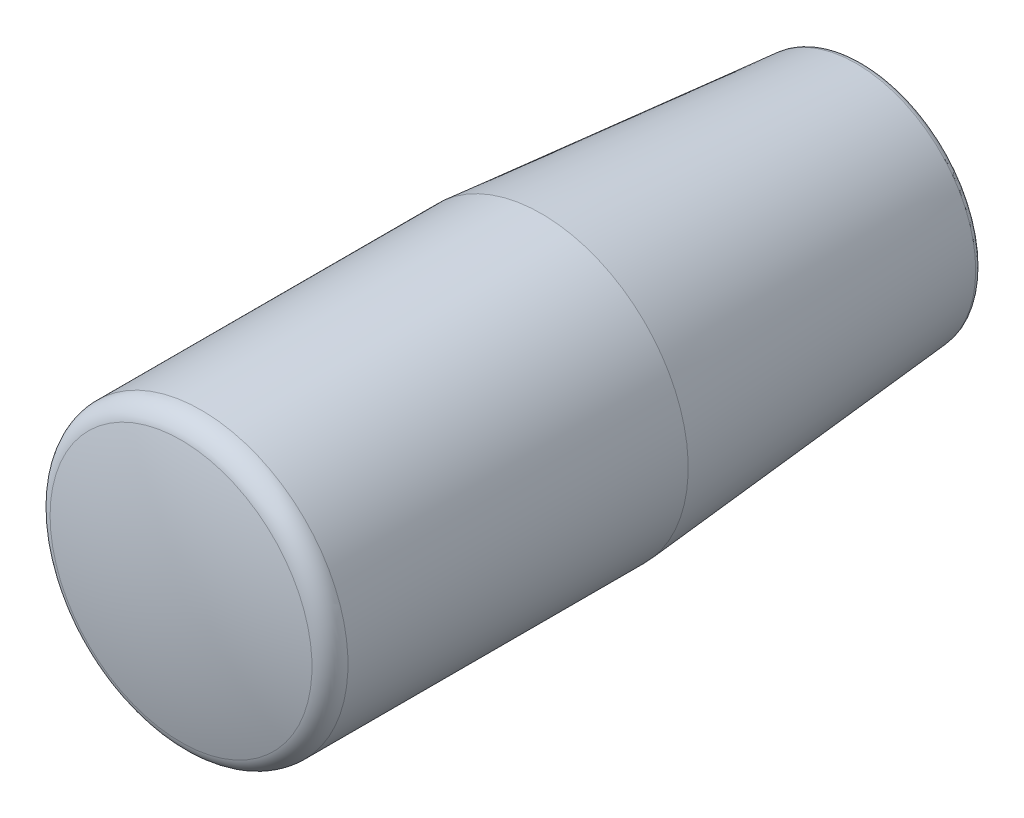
ISO-10303-21;
HEADER;
FILE_DESCRIPTION(('STEP AP214'),'2;1');
FILE_NAME('part.step','',(''),(''),'','','');
FILE_SCHEMA(('AUTOMOTIVE_DESIGN { 1 0 10303 214 1 1 1 1 }'));
ENDSEC;
DATA;
#1=APPLICATION_CONTEXT('core data for automotive mechanical design processes');
#2=APPLICATION_PROTOCOL_DEFINITION('international standard','automotive_design',2000,#1);
#3=PRODUCT_CONTEXT('',#1,'mechanical');
#4=PRODUCT('Part','Part','',(#3));
#5=PRODUCT_RELATED_PRODUCT_CATEGORY('part','',(#4));
#6=PRODUCT_DEFINITION_FORMATION('','',#4);
#7=PRODUCT_DEFINITION_CONTEXT('part definition',#1,'design');
#8=PRODUCT_DEFINITION('design','',#6,#7);
#9=PRODUCT_DEFINITION_SHAPE('','',#8);
#10=(LENGTH_UNIT() NAMED_UNIT(*) SI_UNIT(.MILLI.,.METRE.));
#11=(NAMED_UNIT(*) PLANE_ANGLE_UNIT() SI_UNIT($,.RADIAN.));
#12=(NAMED_UNIT(*) SI_UNIT($,.STERADIAN.) SOLID_ANGLE_UNIT());
#13=UNCERTAINTY_MEASURE_WITH_UNIT(LENGTH_MEASURE(1.E-05),#10,'distance_accuracy_value','');
#14=(GEOMETRIC_REPRESENTATION_CONTEXT(3) GLOBAL_UNCERTAINTY_ASSIGNED_CONTEXT((#13)) GLOBAL_UNIT_ASSIGNED_CONTEXT((#10,
#11,#12)) REPRESENTATION_CONTEXT('',''));
#15=CARTESIAN_POINT('',(0.,0.,0.));
#16=DIRECTION('',(0.,0.,1.));
#17=DIRECTION('',(1.,0.,0.));
#18=AXIS2_PLACEMENT_3D('',#15,#16,#17);
#19=CARTESIAN_POINT('',(0.,0.,0.5));
#20=DIRECTION('',(0.,0.,-1.));
#21=DIRECTION('',(-1.,0.,0.));
#22=AXIS2_PLACEMENT_3D('',#19,#20,#21);
#23=TOROIDAL_SURFACE('',#22,8.04159146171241,0.5);
#24=CARTESIAN_POINT('',(0.,0.,0.));
#25=DIRECTION('',(0.,0.,-1.));
#26=DIRECTION('',(-1.,0.,0.));
#27=AXIS2_PLACEMENT_3D('',#24,#25,#26);
#28=CIRCLE('',#27,8.04159146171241);
#29=CARTESIAN_POINT('',(-8.04159146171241,0.,0.));
#30=VERTEX_POINT('',#29);
#31=EDGE_CURVE('E8',#30,#30,#28,.T.);
#32=ORIENTED_EDGE('',*,*,#31,.F.);
#33=EDGE_LOOP('',(#32));
#34=FACE_BOUND('',#33,.T.);
#35=CARTESIAN_POINT('',(0.,0.,0.456685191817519));
#36=DIRECTION('',(0.,0.,-1.));
#37=DIRECTION('',(-1.,0.,0.));
#38=AXIS2_PLACEMENT_3D('',#35,#36,#37);
#39=CIRCLE('',#38,8.53971175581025);
#40=CARTESIAN_POINT('',(-8.53971175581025,0.,0.456685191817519));
#41=VERTEX_POINT('',#40);
#42=EDGE_CURVE('E37',#41,#41,#39,.T.);
#43=ORIENTED_EDGE('',*,*,#42,.T.);
#44=EDGE_LOOP('',(#43));
#45=FACE_BOUND('',#44,.T.);
#46=ADVANCED_FACE('F12',(#34,#45),#23,.T.);
#47=CARTESIAN_POINT('',(0.,5.,0.));
#48=DIRECTION('',(0.,0.,-1.));
#49=DIRECTION('',(-1.,0.,0.));
#50=AXIS2_PLACEMENT_3D('',#47,#48,#49);
#51=PLANE('',#50);
#52=ORIENTED_EDGE('',*,*,#31,.T.);
#53=EDGE_LOOP('',(#52));
#54=FACE_BOUND('',#53,.T.);
#55=CARTESIAN_POINT('',(0.,0.,0.));
#56=DIRECTION('',(0.,0.,-1.));
#57=DIRECTION('',(-1.,0.,0.));
#58=AXIS2_PLACEMENT_3D('',#55,#56,#57);
#59=CIRCLE('',#58,5.);
#60=CARTESIAN_POINT('',(-5.,0.,0.));
#61=VERTEX_POINT('',#60);
#62=EDGE_CURVE('E18',#61,#61,#59,.T.);
#63=ORIENTED_EDGE('',*,*,#62,.F.);
#64=EDGE_LOOP('',(#63));
#65=FACE_BOUND('',#64,.T.);
#66=ADVANCED_FACE('F56',(#54,#65),#51,.T.);
#67=CARTESIAN_POINT('',(0.,0.,-5.));
#68=DIRECTION('',(0.,0.,-1.));
#69=DIRECTION('',(-1.,0.,0.));
#70=AXIS2_PLACEMENT_3D('',#67,#68,#69);
#71=CYLINDRICAL_SURFACE('',#70,5.);
#72=CARTESIAN_POINT('',(0.,0.,35.));
#73=DIRECTION('',(0.,0.,-1.));
#74=DIRECTION('',(-1.,0.,0.));
#75=AXIS2_PLACEMENT_3D('',#72,#73,#74);
#76=CIRCLE('',#75,5.);
#77=CARTESIAN_POINT('',(-5.,0.,35.));
#78=VERTEX_POINT('',#77);
#79=EDGE_CURVE('E22',#78,#78,#76,.T.);
#80=ORIENTED_EDGE('',*,*,#79,.F.);
#81=EDGE_LOOP('',(#80));
#82=FACE_BOUND('',#81,.T.);
#83=ORIENTED_EDGE('',*,*,#62,.T.);
#84=EDGE_LOOP('',(#83));
#85=FACE_BOUND('',#84,.T.);
#86=ADVANCED_FACE('F62',(#82,#85),#71,.F.);
#87=CARTESIAN_POINT('',(0.,5.,35.));
#88=DIRECTION('',(0.,0.,1.));
#89=DIRECTION('',(1.,0.,0.));
#90=AXIS2_PLACEMENT_3D('',#87,#88,#89);
#91=PLANE('',#90);
#92=ORIENTED_EDGE('',*,*,#79,.T.);
#93=EDGE_LOOP('',(#92));
#94=FACE_BOUND('',#93,.T.);
#95=ADVANCED_FACE('F67',(#94),#91,.F.);
#96=CARTESIAN_POINT('',(0.,0.,12.4999999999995));
#97=DIRECTION('',(-1.,0.,0.));
#98=DIRECTION('',(0.,0.,1.));
#99=AXIS2_PLACEMENT_3D('',#96,#97,#98);
#100=SPHERICAL_SURFACE('',#99,37.5000000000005);
#101=CARTESIAN_POINT('',(0.,0.,12.4999999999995));
#102=DIRECTION('',(0.,0.,-1.));
#103=DIRECTION('',(-1.,0.,0.));
#104=AXIS2_PLACEMENT_3D('',#101,#102,#103);
#105=SPHERICAL_SURFACE('',#104,37.5000000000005);
#106=CARTESIAN_POINT('',(0.,0.,48.8092188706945));
#107=DIRECTION('',(0.,0.,-1.));
#108=DIRECTION('',(-1.,0.,0.));
#109=AXIS2_PLACEMENT_3D('',#106,#107,#108);
#110=CIRCLE('',#109,9.375);
#111=CARTESIAN_POINT('',(-9.375,0.,48.8092188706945));
#112=VERTEX_POINT('',#111);
#113=EDGE_CURVE('E26',#112,#112,#110,.T.);
#114=ORIENTED_EDGE('',*,*,#113,.F.);
#115=EDGE_LOOP('',(#114));
#116=FACE_BOUND('',#115,.T.);
#117=ADVANCED_FACE('F74',(#116),#105,.T.);
#118=CARTESIAN_POINT('',(0.,0.,47.3568501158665));
#119=DIRECTION('',(0.,0.,-1.));
#120=DIRECTION('',(-1.,0.,0.));
#121=AXIS2_PLACEMENT_3D('',#118,#119,#120);
#122=TOROIDAL_SURFACE('',#121,9.,1.5);
#123=CARTESIAN_POINT('',(0.,0.,47.3568501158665));
#124=DIRECTION('',(0.,0.,-1.));
#125=DIRECTION('',(-1.,0.,0.));
#126=AXIS2_PLACEMENT_3D('',#123,#124,#125);
#127=CIRCLE('',#126,10.5);
#128=CARTESIAN_POINT('',(-10.5,0.,47.3568501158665));
#129=VERTEX_POINT('',#128);
#130=EDGE_CURVE('E31',#129,#129,#127,.T.);
#131=ORIENTED_EDGE('',*,*,#130,.F.);
#132=EDGE_LOOP('',(#131));
#133=FACE_BOUND('',#132,.T.);
#134=ORIENTED_EDGE('',*,*,#113,.T.);
#135=EDGE_LOOP('',(#134));
#136=FACE_BOUND('',#135,.T.);
#137=ADVANCED_FACE('F52',(#133,#136),#122,.T.);
#138=CARTESIAN_POINT('',(0.,0.,-5.));
#139=DIRECTION('',(0.,0.,-1.));
#140=DIRECTION('',(-1.,0.,0.));
#141=AXIS2_PLACEMENT_3D('',#138,#139,#140);
#142=CYLINDRICAL_SURFACE('',#141,10.5);
#143=ORIENTED_EDGE('',*,*,#130,.T.);
#144=EDGE_LOOP('',(#143));
#145=FACE_BOUND('',#144,.T.);
#146=CARTESIAN_POINT('',(0.,0.,23.));
#147=DIRECTION('',(0.,0.,-1.));
#148=DIRECTION('',(-1.,0.,0.));
#149=AXIS2_PLACEMENT_3D('',#146,#147,#148);
#150=CIRCLE('',#149,10.5);
#151=CARTESIAN_POINT('',(-10.5,0.,23.));
#152=VERTEX_POINT('',#151);
#153=EDGE_CURVE('E34',#152,#152,#150,.T.);
#154=ORIENTED_EDGE('',*,*,#153,.F.);
#155=EDGE_LOOP('',(#154));
#156=FACE_BOUND('',#155,.T.);
#157=ADVANCED_FACE('F44',(#145,#156),#142,.T.);
#158=CARTESIAN_POINT('',(0.,0.,0.456685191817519));
#159=DIRECTION('',(0.,0.,1.));
#160=DIRECTION('',(1.,0.,0.));
#161=AXIS2_PLACEMENT_3D('',#158,#159,#160);
#162=CONICAL_SURFACE('',#161,8.53971175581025,0.0867383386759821);
#163=ORIENTED_EDGE('',*,*,#153,.T.);
#164=EDGE_LOOP('',(#163));
#165=FACE_BOUND('',#164,.T.);
#166=ORIENTED_EDGE('',*,*,#42,.F.);
#167=EDGE_LOOP('',(#166));
#168=FACE_BOUND('',#167,.T.);
#169=ADVANCED_FACE('F42',(#165,#168),#162,.T.);
#170=CLOSED_SHELL('',(#46,#66,#86,#95,#117,#137,#157,#169));
#171=MANIFOLD_SOLID_BREP('B1',#170);
#172=ADVANCED_BREP_SHAPE_REPRESENTATION('',(#18,#171),#14);
#173=SHAPE_DEFINITION_REPRESENTATION(#9,#172);
ENDSEC;
END-ISO-10303-21;
